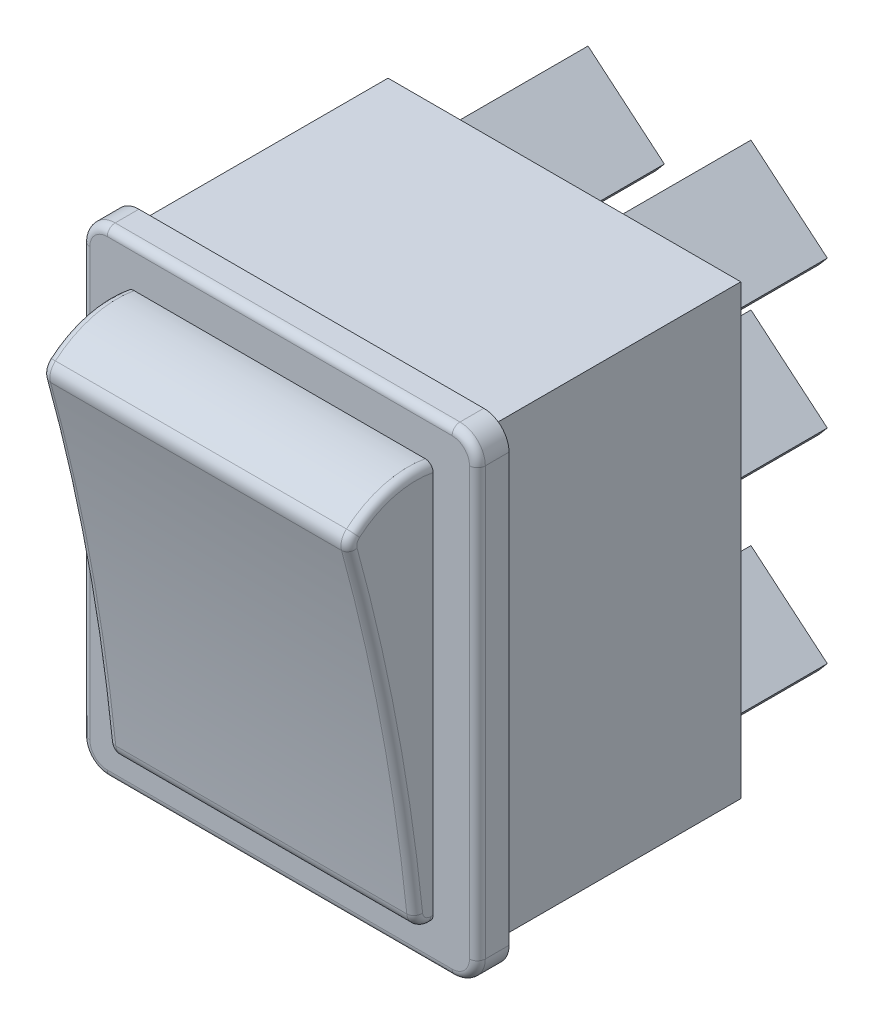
from build123d import *

# Parameters (mm, degrees)
SKETCH1_W      = 25
SKETCH1_H      = 30.2
EXTRUDE1_DEPTH = 2
FILLET1_R      = 1.6
SKETCH2_W      = 22.3
SKETCH2_H      = 28.3
EXTRUDE2_DEPTH = 16
EXTRUDE3_DEPTH = 8.8
EXTRUDE4_START = -2.8
EXTRUDE4_DEPTH = 19.4
FILLET2_R      = 1
FILLET3_R      = 0.5
FILLET4_R      = 0.5


with BuildPart() as part:
    # Sketch1 → Extrude1 (new body)
    with BuildSketch(Plane.XY):
        with Locations((12.5, 15.1)):
            Rectangle(SKETCH1_W, SKETCH1_H)
    extrude(amount=EXTRUDE1_DEPTH)

    # Fillet1
    fillet1_edges = [part.edges().sort_by_distance(p)[0] for p in [
        (0, 30.2, 1),
        (25, 30.2, 1),
        (25, 0, 1),
        (0, 0, 1),
    ]]
    fillet(fillet1_edges, radius=FILLET1_R)

    # Sketch2 → Extrude2 (add)
    with BuildSketch(Plane(origin=(0, 0, 0), x_dir=(-1, 0, 0), z_dir=(0, 0, -1))):
        with Locations((-12.5, 15.1)):
            Rectangle(SKETCH2_W, SKETCH2_H)
    extrude(amount=EXTRUDE2_DEPTH)

    # Sketch3 → Extrude3 (add)
    with BuildSketch(Plane(origin=(0, 0, -16), x_dir=(-1, 0, 0), z_dir=(0, 0, -1))):
        Polygon((-15.494075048, 19.231198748), (-20.32015504, 15.181636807), (-19.805924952, 14.568801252), (-14.97984496, 18.618363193), align=None)
        Polygon((-15.494075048, 28.531198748), (-14.97984496, 27.918363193), (-19.805924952, 23.868801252), (-20.32015504, 24.481636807), align=None)
        Polygon((-15.494075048, 6.331198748), (-20.32015504, 2.281636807), (-19.805924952, 1.668801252), (-14.97984496, 5.718363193), align=None)
        Polygon((-5.194075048, 28.531198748), (-10.02015504, 24.481636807), (-9.505924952, 23.868801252), (-4.67984496, 27.918363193), align=None)
        Polygon((-5.194075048, 19.231198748), (-10.02015504, 15.181636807), (-9.505924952, 14.568801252), (-4.67984496, 18.618363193), align=None)
        Polygon((-5.194075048, 6.331198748), (-10.02015504, 2.281636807), (-9.505924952, 1.668801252), (-4.67984496, 5.718363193), align=None)
    extrude(amount=EXTRUDE3_DEPTH)

    # Sketch4 → Extrude4 (add)
    with BuildSketch(Plane(origin=(25, 0, 0), x_dir=(0, 0, -1), z_dir=(1, 0, 0)).offset(EXTRUDE4_START)):
        with BuildLine():
            Line((-3.070931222, 2.348411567), (-2, 2.348411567))
            Line((-2, 2.348411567), (-2, 27.589076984))
            ThreePointArc((-2, 27.589076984), (-4.95422006, 27.381179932), (-7.445389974, 25.779708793))
            ThreePointArc((-7.445389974, 25.779708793), (-4.743042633, 14.160229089), (-3.070931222, 2.348411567))
        make_face()
    extrude(amount=-EXTRUDE4_DEPTH)

    # Fillet2
    fillet2_edges = [part.edges().sort_by_distance(p)[0] for p in [
        (12.5, 2.348411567, 3.070931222),
        (12.5, 25.779708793, 7.445389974),
    ]]
    fillet(fillet2_edges, radius=FILLET2_R)

    # Fillet3
    fillet3_edges = [part.edges().sort_by_distance(p)[0] for p in [
        (22.2, 27.475312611, 4.642826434),
        (2.8, 2.348411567, 2.083128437),
        (2.8, 27.475312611, 4.642826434),
        (22.2, 14.312627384, 4.771584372),
        (22.2, 2.348411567, 2.083128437),
        (22.2, 2.605733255, 2.835905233),
        (22.2, 25.765430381, 7.280083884),
        (2.8, 14.312627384, 4.771584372),
        (2.8, 2.605733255, 2.835905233),
        (2.8, 25.765430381, 7.280083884),
    ]]
    fillet(fillet3_edges, radius=FILLET3_R)

    # Fillet4
    fillet4_edges = [part.edges().sort_by_distance(p)[0] for p in [
        (12.5, 0, 2),
        (0, 15.1, 2),
        (25, 15.1, 2),
        (12.5, 30.2, 2),
        (0.46862915, 29.73137085, 2),
        (24.53137085, 29.73137085, 2),
        (24.53137085, 0.46862915, 2),
        (0.46862915, 0.46862915, 2),
    ]]
    fillet(fillet4_edges, radius=FILLET4_R)


solid = part.part
